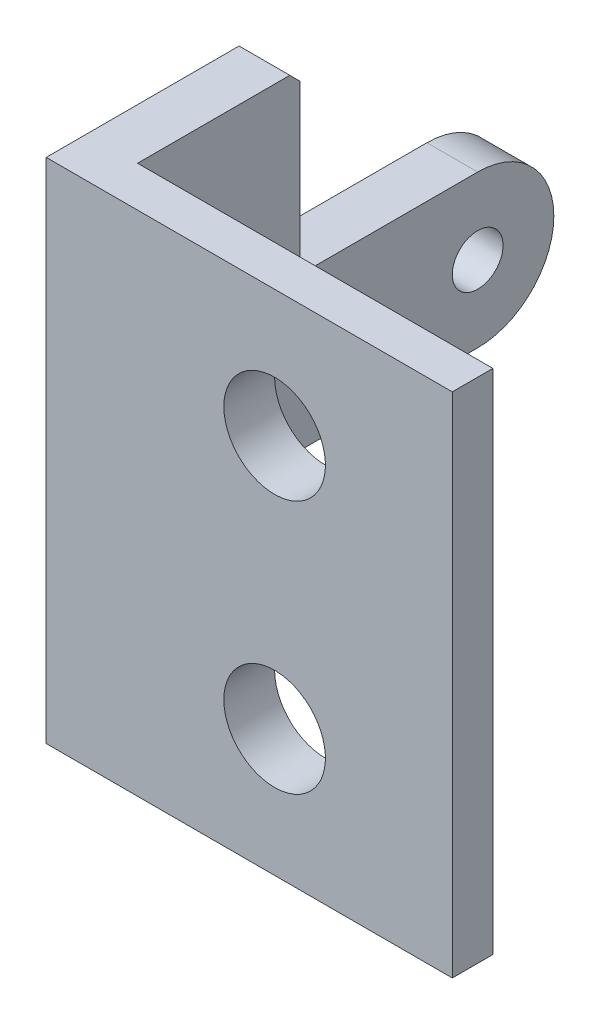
from build123d import *

# Parameters (mm, degrees)
BOSS_EXTRUDE1_DEPTH = 100
SKETCH2_R           = 5
BOSS_EXTRUDE2_DEPTH = 10
SKETCH3_R           = 10
CUT_EXTRUDE1_DEPTH  = 10
CHAMFER1_SIZE       = 2


with BuildPart() as part:
    # Sketch1 → Boss-Extrude1 (new body)
    with BuildSketch(Plane(origin=(0, 0, 0), x_dir=(1, 0, 0), z_dir=(0, 1, 0))):
        Polygon((0, 40), (0, 0), (80, 0), (80, 10), (10, 10), (10, 40), align=None)
    extrude(amount=BOSS_EXTRUDE1_DEPTH)

    # Sketch2 → Boss-Extrude2 (add)
    with BuildSketch(Plane.ZY):
        with BuildLine():
            Line((-40, 35), (-75, 35))
            ThreePointArc((-75, 35), (-90, 50), (-75, 65))
            Line((-75, 65), (-40, 65))
            Line((-40, 65), (-40, 35))
        make_face()
        with Locations((-75, 50)):
            Circle(SKETCH2_R, mode=Mode.SUBTRACT)
    extrude(amount=-BOSS_EXTRUDE2_DEPTH)

    # Sketch3 → Cut-Extrude1 (cut)
    with BuildSketch(Plane(origin=(0, 0, -10), x_dir=(-1, 0, 0), z_dir=(0, 0, -1))):
        with Locations((-45, 75)):
            Circle(SKETCH3_R)
        with Locations((-45, 25)):
            Circle(SKETCH3_R)
    extrude(amount=-CUT_EXTRUDE1_DEPTH, mode=Mode.SUBTRACT)

    # Chamfer1
    chamfer1_edges = [part.edges().sort_by_distance(p)[0] for p in [
        (80, 50, -10),
        (45, 100, -10),
        (5, 100, -40),
        (45, 0, -10),
        (5, 0, -40),
    ]]
    chamfer(chamfer1_edges, length=CHAMFER1_SIZE)


solid = part.part
